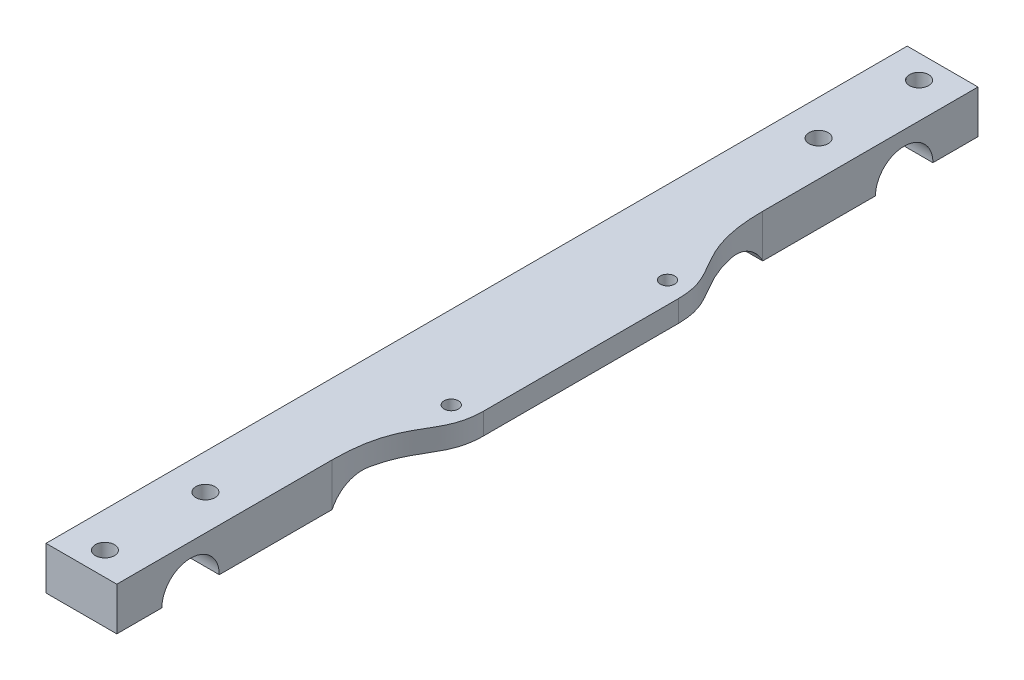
ISO-10303-21;
HEADER;
FILE_DESCRIPTION(('STEP AP214'),'2;1');
FILE_NAME('part.step','',(''),(''),'','','');
FILE_SCHEMA(('AUTOMOTIVE_DESIGN { 1 0 10303 214 1 1 1 1 }'));
ENDSEC;
DATA;
#1=APPLICATION_CONTEXT('core data for automotive mechanical design processes');
#2=APPLICATION_PROTOCOL_DEFINITION('international standard','automotive_design',2000,#1);
#3=PRODUCT_CONTEXT('',#1,'mechanical');
#4=PRODUCT('Part','Part','',(#3));
#5=PRODUCT_RELATED_PRODUCT_CATEGORY('part','',(#4));
#6=PRODUCT_DEFINITION_FORMATION('','',#4);
#7=PRODUCT_DEFINITION_CONTEXT('part definition',#1,'design');
#8=PRODUCT_DEFINITION('design','',#6,#7);
#9=PRODUCT_DEFINITION_SHAPE('','',#8);
#10=(LENGTH_UNIT() NAMED_UNIT(*) SI_UNIT(.MILLI.,.METRE.));
#11=(NAMED_UNIT(*) PLANE_ANGLE_UNIT() SI_UNIT($,.RADIAN.));
#12=(NAMED_UNIT(*) SI_UNIT($,.STERADIAN.) SOLID_ANGLE_UNIT());
#13=UNCERTAINTY_MEASURE_WITH_UNIT(LENGTH_MEASURE(1.E-05),#10,'distance_accuracy_value','');
#14=(GEOMETRIC_REPRESENTATION_CONTEXT(3) GLOBAL_UNCERTAINTY_ASSIGNED_CONTEXT((#13)) GLOBAL_UNIT_ASSIGNED_CONTEXT((#10,
#11,#12)) REPRESENTATION_CONTEXT('',''));
#15=CARTESIAN_POINT('',(0.,0.,0.));
#16=DIRECTION('',(0.,0.,1.));
#17=DIRECTION('',(1.,0.,0.));
#18=AXIS2_PLACEMENT_3D('',#15,#16,#17);
#19=CARTESIAN_POINT('',(14.8,0.,0.));
#20=DIRECTION('',(-1.,0.,0.));
#21=DIRECTION('',(0.,0.,1.));
#22=AXIS2_PLACEMENT_3D('',#19,#20,#21);
#23=PLANE('',#22);
#24=DIRECTION('',(0.,0.,1.));
#25=VECTOR('',#24,1.);
#26=CARTESIAN_POINT('',(14.8,4.5,90.));
#27=LINE('',#26,#25);
#28=CARTESIAN_POINT('',(14.8,4.5,45.));
#29=VERTEX_POINT('',#28);
#30=CARTESIAN_POINT('',(14.8,4.5,90.));
#31=VERTEX_POINT('',#30);
#32=EDGE_CURVE('E336',#29,#31,#27,.T.);
#33=ORIENTED_EDGE('',*,*,#32,.T.);
#34=DIRECTION('',(0.,-1.,0.));
#35=VECTOR('',#34,1.);
#36=CARTESIAN_POINT('',(14.8,-4.5,90.));
#37=LINE('',#36,#35);
#38=CARTESIAN_POINT('',(14.8,-4.5,90.));
#39=VERTEX_POINT('',#38);
#40=EDGE_CURVE('E340',#31,#39,#37,.T.);
#41=ORIENTED_EDGE('',*,*,#40,.T.);
#42=DIRECTION('',(0.,0.,-1.));
#43=VECTOR('',#42,1.);
#44=CARTESIAN_POINT('',(14.8,-4.5,90.));
#45=LINE('',#44,#43);
#46=CARTESIAN_POINT('',(14.8,-4.5,80.579));
#47=VERTEX_POINT('',#46);
#48=EDGE_CURVE('E368',#39,#47,#45,.T.);
#49=ORIENTED_EDGE('',*,*,#48,.T.);
#50=CARTESIAN_POINT('',(14.8,-4.5,74.579));
#51=DIRECTION('',(1.,0.,0.));
#52=DIRECTION('',(0.,0.,-1.));
#53=AXIS2_PLACEMENT_3D('',#50,#51,#52);
#54=CIRCLE('',#53,6.00000000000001);
#55=CARTESIAN_POINT('',(14.8,-4.5,68.579));
#56=VERTEX_POINT('',#55);
#57=EDGE_CURVE('E317',#56,#47,#54,.T.);
#58=ORIENTED_EDGE('',*,*,#57,.F.);
#59=CARTESIAN_POINT('',(14.8,-4.5,45.));
#60=VERTEX_POINT('',#59);
#61=EDGE_CURVE('E380',#56,#60,#45,.T.);
#62=ORIENTED_EDGE('',*,*,#61,.T.);
#63=DIRECTION('',(0.,-1.,0.));
#64=VECTOR('',#63,1.);
#65=CARTESIAN_POINT('',(14.8,0.,45.));
#66=LINE('',#65,#64);
#67=EDGE_CURVE('E79',#29,#60,#66,.T.);
#68=ORIENTED_EDGE('',*,*,#67,.F.);
#69=EDGE_LOOP('',(#33,#41,#49,#58,#62,#68));
#70=FACE_BOUND('',#69,.T.);
#71=ADVANCED_FACE('F41',(#70),#23,.F.);
#72=CARTESIAN_POINT('',(14.8,4.5,-90.));
#73=VERTEX_POINT('',#72);
#74=CARTESIAN_POINT('',(14.8,4.5,-45.));
#75=VERTEX_POINT('',#74);
#76=EDGE_CURVE('E88',#73,#75,#27,.T.);
#77=ORIENTED_EDGE('',*,*,#76,.T.);
#78=DIRECTION('',(0.,1.,0.));
#79=VECTOR('',#78,1.);
#80=CARTESIAN_POINT('',(14.8,0.,-45.));
#81=LINE('',#80,#79);
#82=CARTESIAN_POINT('',(14.8,-4.49999999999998,-45.));
#83=VERTEX_POINT('',#82);
#84=EDGE_CURVE('E57',#83,#75,#81,.T.);
#85=ORIENTED_EDGE('',*,*,#84,.F.);
#86=CARTESIAN_POINT('',(14.8,-4.5,-68.579));
#87=VERTEX_POINT('',#86);
#88=EDGE_CURVE('E381',#83,#87,#45,.T.);
#89=ORIENTED_EDGE('',*,*,#88,.T.);
#90=CARTESIAN_POINT('',(14.8,-4.5,-74.579));
#91=DIRECTION('',(1.,0.,0.));
#92=DIRECTION('',(0.,0.,-1.));
#93=AXIS2_PLACEMENT_3D('',#90,#91,#92);
#94=CIRCLE('',#93,6.00000000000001);
#95=CARTESIAN_POINT('',(14.8,-4.5,-80.579));
#96=VERTEX_POINT('',#95);
#97=EDGE_CURVE('E319',#96,#87,#94,.T.);
#98=ORIENTED_EDGE('',*,*,#97,.F.);
#99=CARTESIAN_POINT('',(14.8,-4.5,-90.));
#100=VERTEX_POINT('',#99);
#101=EDGE_CURVE('E385',#96,#100,#45,.T.);
#102=ORIENTED_EDGE('',*,*,#101,.T.);
#103=DIRECTION('',(0.,1.,0.));
#104=VECTOR('',#103,1.);
#105=CARTESIAN_POINT('',(14.8,-4.5,-90.));
#106=LINE('',#105,#104);
#107=EDGE_CURVE('E334',#100,#73,#106,.T.);
#108=ORIENTED_EDGE('',*,*,#107,.T.);
#109=EDGE_LOOP('',(#77,#85,#89,#98,#102,#108));
#110=FACE_BOUND('',#109,.T.);
#111=ADVANCED_FACE('F214',(#110),#23,.F.);
#112=CARTESIAN_POINT('',(14.8,-4.5,90.));
#113=DIRECTION('',(0.,1.,0.));
#114=DIRECTION('',(0.,0.,1.));
#115=AXIS2_PLACEMENT_3D('',#112,#113,#114);
#116=PLANE('',#115);
#117=CARTESIAN_POINT('',(7.40000000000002,-4.5,64.079));
#118=DIRECTION('',(0.,1.,0.));
#119=DIRECTION('',(0.,0.,1.));
#120=AXIS2_PLACEMENT_3D('',#117,#118,#119);
#121=CIRCLE('',#120,2.);
#122=CARTESIAN_POINT('',(7.40000000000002,-4.5,66.079));
#123=VERTEX_POINT('',#122);
#124=EDGE_CURVE('E289',#123,#123,#121,.T.);
#125=ORIENTED_EDGE('',*,*,#124,.T.);
#126=EDGE_LOOP('',(#125));
#127=FACE_BOUND('',#126,.T.);
#128=DIRECTION('',(0.,0.,-1.));
#129=VECTOR('',#128,1.);
#130=CARTESIAN_POINT('',(0.,-4.5,90.));
#131=LINE('',#130,#129);
#132=CARTESIAN_POINT('',(0.,-4.5,68.579));
#133=VERTEX_POINT('',#132);
#134=CARTESIAN_POINT('',(0.,-4.5,45.));
#135=VERTEX_POINT('',#134);
#136=EDGE_CURVE('E371',#133,#135,#131,.T.);
#137=ORIENTED_EDGE('',*,*,#136,.T.);
#138=DIRECTION('',(1.,0.,0.));
#139=VECTOR('',#138,1.);
#140=CARTESIAN_POINT('',(0.,-4.5,45.));
#141=LINE('',#140,#139);
#142=EDGE_CURVE('E283',#135,#60,#141,.T.);
#143=ORIENTED_EDGE('',*,*,#142,.T.);
#144=ORIENTED_EDGE('',*,*,#61,.F.);
#145=DIRECTION('',(1.,0.,0.));
#146=VECTOR('',#145,1.);
#147=CARTESIAN_POINT('',(0.,-4.5,68.579));
#148=LINE('',#147,#146);
#149=EDGE_CURVE('E316',#133,#56,#148,.T.);
#150=ORIENTED_EDGE('',*,*,#149,.F.);
#151=EDGE_LOOP('',(#137,#143,#144,#150));
#152=FACE_BOUND('',#151,.T.);
#153=ADVANCED_FACE('F207',(#127,#152),#116,.F.);
#154=CARTESIAN_POINT('',(7.40000000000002,-4.5,85.079));
#155=DIRECTION('',(0.,1.,0.));
#156=DIRECTION('',(0.,0.,1.));
#157=AXIS2_PLACEMENT_3D('',#154,#155,#156);
#158=CIRCLE('',#157,2.);
#159=CARTESIAN_POINT('',(7.40000000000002,-4.5,87.079));
#160=VERTEX_POINT('',#159);
#161=EDGE_CURVE('E296',#160,#160,#158,.T.);
#162=ORIENTED_EDGE('',*,*,#161,.T.);
#163=EDGE_LOOP('',(#162));
#164=FACE_BOUND('',#163,.T.);
#165=CARTESIAN_POINT('',(0.,-4.5,90.));
#166=VERTEX_POINT('',#165);
#167=CARTESIAN_POINT('',(0.,-4.5,80.579));
#168=VERTEX_POINT('',#167);
#169=EDGE_CURVE('E337',#166,#168,#131,.T.);
#170=ORIENTED_EDGE('',*,*,#169,.T.);
#171=DIRECTION('',(1.,0.,0.));
#172=VECTOR('',#171,1.);
#173=CARTESIAN_POINT('',(0.,-4.5,80.579));
#174=LINE('',#173,#172);
#175=EDGE_CURVE('E320',#168,#47,#174,.T.);
#176=ORIENTED_EDGE('',*,*,#175,.T.);
#177=ORIENTED_EDGE('',*,*,#48,.F.);
#178=DIRECTION('',(-1.,0.,0.));
#179=VECTOR('',#178,1.);
#180=CARTESIAN_POINT('',(14.8,-4.5,90.));
#181=LINE('',#180,#179);
#182=EDGE_CURVE('E362',#39,#166,#181,.T.);
#183=ORIENTED_EDGE('',*,*,#182,.T.);
#184=EDGE_LOOP('',(#170,#176,#177,#183));
#185=FACE_BOUND('',#184,.T.);
#186=ADVANCED_FACE('F396',(#164,#185),#116,.F.);
#187=CARTESIAN_POINT('',(7.40000000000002,-4.5,-64.079));
#188=DIRECTION('',(0.,1.,0.));
#189=DIRECTION('',(0.,0.,1.));
#190=AXIS2_PLACEMENT_3D('',#187,#188,#189);
#191=CIRCLE('',#190,2.);
#192=CARTESIAN_POINT('',(7.40000000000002,-4.5,-62.079));
#193=VERTEX_POINT('',#192);
#194=EDGE_CURVE('E307',#193,#193,#191,.T.);
#195=ORIENTED_EDGE('',*,*,#194,.T.);
#196=EDGE_LOOP('',(#195));
#197=FACE_BOUND('',#196,.T.);
#198=ORIENTED_EDGE('',*,*,#88,.F.);
#199=DIRECTION('',(1.,0.,0.));
#200=VECTOR('',#199,1.);
#201=CARTESIAN_POINT('',(0.,-4.49999999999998,-45.));
#202=LINE('',#201,#200);
#203=CARTESIAN_POINT('',(0.,-4.49999999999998,-45.));
#204=VERTEX_POINT('',#203);
#205=EDGE_CURVE('E284',#204,#83,#202,.T.);
#206=ORIENTED_EDGE('',*,*,#205,.F.);
#207=CARTESIAN_POINT('',(0.,-4.5,-68.579));
#208=VERTEX_POINT('',#207);
#209=EDGE_CURVE('E372',#204,#208,#131,.T.);
#210=ORIENTED_EDGE('',*,*,#209,.T.);
#211=DIRECTION('',(1.,0.,0.));
#212=VECTOR('',#211,1.);
#213=CARTESIAN_POINT('',(0.,-4.5,-68.579));
#214=LINE('',#213,#212);
#215=EDGE_CURVE('E310',#208,#87,#214,.T.);
#216=ORIENTED_EDGE('',*,*,#215,.T.);
#217=EDGE_LOOP('',(#198,#206,#210,#216));
#218=FACE_BOUND('',#217,.T.);
#219=ADVANCED_FACE('F193',(#197,#218),#116,.F.);
#220=CARTESIAN_POINT('',(14.8,-4.5,-90.));
#221=DIRECTION('',(0.,0.,1.));
#222=DIRECTION('',(1.,0.,0.));
#223=AXIS2_PLACEMENT_3D('',#220,#221,#222);
#224=PLANE('',#223);
#225=DIRECTION('',(0.,1.,0.));
#226=VECTOR('',#225,1.);
#227=CARTESIAN_POINT('',(0.,-4.5,-90.));
#228=LINE('',#227,#226);
#229=CARTESIAN_POINT('',(0.,-4.5,-90.));
#230=VERTEX_POINT('',#229);
#231=CARTESIAN_POINT('',(0.,4.5,-90.));
#232=VERTEX_POINT('',#231);
#233=EDGE_CURVE('E323',#230,#232,#228,.T.);
#234=ORIENTED_EDGE('',*,*,#233,.T.);
#235=DIRECTION('',(-1.,0.,0.));
#236=VECTOR('',#235,1.);
#237=CARTESIAN_POINT('',(14.8,4.5,-90.));
#238=LINE('',#237,#236);
#239=EDGE_CURVE('E356',#73,#232,#238,.T.);
#240=ORIENTED_EDGE('',*,*,#239,.F.);
#241=ORIENTED_EDGE('',*,*,#107,.F.);
#242=DIRECTION('',(-1.,0.,0.));
#243=VECTOR('',#242,1.);
#244=CARTESIAN_POINT('',(14.8,-4.5,-90.));
#245=LINE('',#244,#243);
#246=EDGE_CURVE('E365',#100,#230,#245,.T.);
#247=ORIENTED_EDGE('',*,*,#246,.T.);
#248=EDGE_LOOP('',(#234,#240,#241,#247));
#249=FACE_BOUND('',#248,.T.);
#250=ADVANCED_FACE('F189',(#249),#224,.F.);
#251=CARTESIAN_POINT('',(14.8,4.5,90.));
#252=DIRECTION('',(0.,-1.,0.));
#253=DIRECTION('',(0.,0.,-1.));
#254=AXIS2_PLACEMENT_3D('',#251,#252,#253);
#255=PLANE('',#254);
#256=CARTESIAN_POINT('',(17.2994949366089,4.5,22.6005050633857));
#257=DIRECTION('',(0.,-1.,0.));
#258=DIRECTION('',(0.,0.,-1.));
#259=AXIS2_PLACEMENT_3D('',#256,#257,#258);
#260=CIRCLE('',#259,1.50000000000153);
#261=CARTESIAN_POINT('',(17.2994949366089,4.5,21.1005050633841));
#262=VERTEX_POINT('',#261);
#263=EDGE_CURVE('E264',#262,#262,#260,.T.);
#264=ORIENTED_EDGE('',*,*,#263,.T.);
#265=EDGE_LOOP('',(#264));
#266=FACE_BOUND('',#265,.T.);
#267=CARTESIAN_POINT('',(17.2994949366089,4.5,-22.6005050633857));
#268=DIRECTION('',(0.,-1.,0.));
#269=DIRECTION('',(0.,0.,-1.));
#270=AXIS2_PLACEMENT_3D('',#267,#268,#269);
#271=CIRCLE('',#270,1.50000000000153);
#272=CARTESIAN_POINT('',(17.2994949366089,4.5,-24.1005050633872));
#273=VERTEX_POINT('',#272);
#274=EDGE_CURVE('E262',#273,#273,#271,.T.);
#275=ORIENTED_EDGE('',*,*,#274,.T.);
#276=EDGE_LOOP('',(#275));
#277=FACE_BOUND('',#276,.T.);
#278=CARTESIAN_POINT('',(7.40000000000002,4.5,-85.079));
#279=DIRECTION('',(0.,1.,0.));
#280=DIRECTION('',(0.,0.,1.));
#281=AXIS2_PLACEMENT_3D('',#278,#279,#280);
#282=CIRCLE('',#281,2.);
#283=CARTESIAN_POINT('',(7.40000000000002,4.5,-83.079));
#284=VERTEX_POINT('',#283);
#285=EDGE_CURVE('E287',#284,#284,#282,.T.);
#286=ORIENTED_EDGE('',*,*,#285,.F.);
#287=EDGE_LOOP('',(#286));
#288=FACE_BOUND('',#287,.T.);
#289=CARTESIAN_POINT('',(7.40000000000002,4.5,85.079));
#290=DIRECTION('',(0.,1.,0.));
#291=DIRECTION('',(0.,0.,1.));
#292=AXIS2_PLACEMENT_3D('',#289,#290,#291);
#293=CIRCLE('',#292,2.);
#294=CARTESIAN_POINT('',(7.40000000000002,4.5,87.079));
#295=VERTEX_POINT('',#294);
#296=EDGE_CURVE('E299',#295,#295,#293,.T.);
#297=ORIENTED_EDGE('',*,*,#296,.F.);
#298=EDGE_LOOP('',(#297));
#299=FACE_BOUND('',#298,.T.);
#300=CARTESIAN_POINT('',(7.40000000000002,4.5,64.079));
#301=DIRECTION('',(0.,1.,0.));
#302=DIRECTION('',(0.,0.,1.));
#303=AXIS2_PLACEMENT_3D('',#300,#301,#302);
#304=CIRCLE('',#303,2.);
#305=CARTESIAN_POINT('',(7.40000000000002,4.5,66.079));
#306=VERTEX_POINT('',#305);
#307=EDGE_CURVE('E293',#306,#306,#304,.T.);
#308=ORIENTED_EDGE('',*,*,#307,.F.);
#309=EDGE_LOOP('',(#308));
#310=FACE_BOUND('',#309,.T.);
#311=CARTESIAN_POINT('',(7.40000000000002,4.5,-64.079));
#312=DIRECTION('',(0.,1.,0.));
#313=DIRECTION('',(0.,0.,1.));
#314=AXIS2_PLACEMENT_3D('',#311,#312,#313);
#315=CIRCLE('',#314,2.);
#316=CARTESIAN_POINT('',(7.40000000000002,4.5,-62.079));
#317=VERTEX_POINT('',#316);
#318=EDGE_CURVE('E292',#317,#317,#315,.T.);
#319=ORIENTED_EDGE('',*,*,#318,.F.);
#320=EDGE_LOOP('',(#319));
#321=FACE_BOUND('',#320,.T.);
#322=DIRECTION('',(0.,0.,1.));
#323=VECTOR('',#322,1.);
#324=CARTESIAN_POINT('',(21.8,4.5,45.));
#325=LINE('',#324,#323);
#326=CARTESIAN_POINT('',(21.8,4.5,-20.3664277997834));
#327=VERTEX_POINT('',#326);
#328=CARTESIAN_POINT('',(21.8,4.5,20.3664277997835));
#329=VERTEX_POINT('',#328);
#330=EDGE_CURVE('E278',#327,#329,#325,.T.);
#331=ORIENTED_EDGE('',*,*,#330,.F.);
#332=CARTESIAN_POINT('',(21.8,4.50000000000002,-20.3664277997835));
#333=CARTESIAN_POINT('',(21.8,4.50000000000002,-29.7858355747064));
#334=CARTESIAN_POINT('',(14.8,4.50000000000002,-29.7858355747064));
#335=CARTESIAN_POINT('',(14.8,4.50000000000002,-45.));
#336=B_SPLINE_CURVE_WITH_KNOTS('',3,(#332,#333,#334,#335),.UNSPECIFIED.,.F.,.F.,(4,4),(0.,1.),.UNSPECIFIED.);
#337=EDGE_CURVE('E265',#327,#75,#336,.T.);
#338=ORIENTED_EDGE('',*,*,#337,.T.);
#339=ORIENTED_EDGE('',*,*,#76,.F.);
#340=ORIENTED_EDGE('',*,*,#239,.T.);
#341=DIRECTION('',(0.,0.,1.));
#342=VECTOR('',#341,1.);
#343=CARTESIAN_POINT('',(0.,4.5,90.));
#344=LINE('',#343,#342);
#345=CARTESIAN_POINT('',(0.,4.5,90.));
#346=VERTEX_POINT('',#345);
#347=EDGE_CURVE('E376',#232,#346,#344,.T.);
#348=ORIENTED_EDGE('',*,*,#347,.T.);
#349=DIRECTION('',(-1.,0.,0.));
#350=VECTOR('',#349,1.);
#351=CARTESIAN_POINT('',(14.8,4.5,90.));
#352=LINE('',#351,#350);
#353=EDGE_CURVE('E359',#31,#346,#352,.T.);
#354=ORIENTED_EDGE('',*,*,#353,.F.);
#355=ORIENTED_EDGE('',*,*,#32,.F.);
#356=CARTESIAN_POINT('',(14.8,4.50000000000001,45.));
#357=CARTESIAN_POINT('',(14.8,4.50000000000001,29.7858355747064));
#358=CARTESIAN_POINT('',(21.8,4.50000000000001,29.7858355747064));
#359=CARTESIAN_POINT('',(21.8,4.50000000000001,20.3664277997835));
#360=B_SPLINE_CURVE_WITH_KNOTS('',3,(#356,#357,#358,#359),.UNSPECIFIED.,.F.,.F.,(4,4),(0.,1.),.UNSPECIFIED.);
#361=EDGE_CURVE('E270',#29,#329,#360,.T.);
#362=ORIENTED_EDGE('',*,*,#361,.T.);
#363=EDGE_LOOP('',(#331,#338,#339,#340,#348,#354,#355,#362));
#364=FACE_BOUND('',#363,.T.);
#365=ADVANCED_FACE('F192',(#266,#277,#288,#299,#310,#321,#364),#255,.F.);
#366=CARTESIAN_POINT('',(14.8,-4.5,90.));
#367=DIRECTION('',(0.,0.,-1.));
#368=DIRECTION('',(-1.,0.,0.));
#369=AXIS2_PLACEMENT_3D('',#366,#367,#368);
#370=PLANE('',#369);
#371=DIRECTION('',(0.,-1.,0.));
#372=VECTOR('',#371,1.);
#373=CARTESIAN_POINT('',(0.,-4.5,90.));
#374=LINE('',#373,#372);
#375=EDGE_CURVE('E373',#346,#166,#374,.T.);
#376=ORIENTED_EDGE('',*,*,#375,.T.);
#377=ORIENTED_EDGE('',*,*,#182,.F.);
#378=ORIENTED_EDGE('',*,*,#40,.F.);
#379=ORIENTED_EDGE('',*,*,#353,.T.);
#380=EDGE_LOOP('',(#376,#377,#378,#379));
#381=FACE_BOUND('',#380,.T.);
#382=ADVANCED_FACE('F197',(#381),#370,.F.);
#383=CARTESIAN_POINT('',(7.40000000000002,-4.5,-85.079));
#384=DIRECTION('',(0.,1.,0.));
#385=DIRECTION('',(0.,0.,1.));
#386=AXIS2_PLACEMENT_3D('',#383,#384,#385);
#387=CIRCLE('',#386,2.);
#388=CARTESIAN_POINT('',(7.40000000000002,-4.5,-83.079));
#389=VERTEX_POINT('',#388);
#390=EDGE_CURVE('E302',#389,#389,#387,.T.);
#391=ORIENTED_EDGE('',*,*,#390,.T.);
#392=EDGE_LOOP('',(#391));
#393=FACE_BOUND('',#392,.T.);
#394=ORIENTED_EDGE('',*,*,#101,.F.);
#395=DIRECTION('',(1.,0.,0.));
#396=VECTOR('',#395,1.);
#397=CARTESIAN_POINT('',(0.,-4.5,-80.579));
#398=LINE('',#397,#396);
#399=CARTESIAN_POINT('',(0.,-4.5,-80.579));
#400=VERTEX_POINT('',#399);
#401=EDGE_CURVE('E325',#400,#96,#398,.T.);
#402=ORIENTED_EDGE('',*,*,#401,.F.);
#403=EDGE_CURVE('E375',#400,#230,#131,.T.);
#404=ORIENTED_EDGE('',*,*,#403,.T.);
#405=ORIENTED_EDGE('',*,*,#246,.F.);
#406=EDGE_LOOP('',(#394,#402,#404,#405));
#407=FACE_BOUND('',#406,.T.);
#408=ADVANCED_FACE('F201',(#393,#407),#116,.F.);
#409=CARTESIAN_POINT('',(0.,0.,0.));
#410=DIRECTION('',(-1.,0.,0.));
#411=DIRECTION('',(0.,0.,1.));
#412=AXIS2_PLACEMENT_3D('',#409,#410,#411);
#413=PLANE('',#412);
#414=DIRECTION('',(0.,0.,1.));
#415=VECTOR('',#414,1.);
#416=CARTESIAN_POINT('',(0.,0.,45.));
#417=LINE('',#416,#415);
#418=CARTESIAN_POINT('',(0.,0.,-37.8062527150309));
#419=VERTEX_POINT('',#418);
#420=CARTESIAN_POINT('',(0.,0.,37.8062527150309));
#421=VERTEX_POINT('',#420);
#422=EDGE_CURVE('E281',#419,#421,#417,.T.);
#423=ORIENTED_EDGE('',*,*,#422,.T.);
#424=CARTESIAN_POINT('',(0.,-8.,37.8062527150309));
#425=DIRECTION('',(-1.,0.,0.));
#426=DIRECTION('',(0.,0.,1.));
#427=AXIS2_PLACEMENT_3D('',#424,#425,#426);
#428=CIRCLE('',#427,8.);
#429=EDGE_CURVE('E157',#421,#135,#428,.F.);
#430=ORIENTED_EDGE('',*,*,#429,.T.);
#431=ORIENTED_EDGE('',*,*,#136,.F.);
#432=CARTESIAN_POINT('',(0.,-4.5,74.579));
#433=DIRECTION('',(1.,0.,0.));
#434=DIRECTION('',(0.,0.,-1.));
#435=AXIS2_PLACEMENT_3D('',#432,#433,#434);
#436=CIRCLE('',#435,6.00000000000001);
#437=EDGE_CURVE('E313',#133,#168,#436,.T.);
#438=ORIENTED_EDGE('',*,*,#437,.T.);
#439=ORIENTED_EDGE('',*,*,#169,.F.);
#440=ORIENTED_EDGE('',*,*,#375,.F.);
#441=ORIENTED_EDGE('',*,*,#347,.F.);
#442=ORIENTED_EDGE('',*,*,#233,.F.);
#443=ORIENTED_EDGE('',*,*,#403,.F.);
#444=CARTESIAN_POINT('',(0.,-4.5,-74.579));
#445=DIRECTION('',(1.,0.,0.));
#446=DIRECTION('',(0.,0.,-1.));
#447=AXIS2_PLACEMENT_3D('',#444,#445,#446);
#448=CIRCLE('',#447,6.00000000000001);
#449=EDGE_CURVE('E327',#400,#208,#448,.T.);
#450=ORIENTED_EDGE('',*,*,#449,.T.);
#451=ORIENTED_EDGE('',*,*,#209,.F.);
#452=CARTESIAN_POINT('',(0.,-7.99999999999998,-37.8062527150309));
#453=DIRECTION('',(-1.,0.,0.));
#454=DIRECTION('',(0.,0.,1.));
#455=AXIS2_PLACEMENT_3D('',#452,#453,#454);
#456=CIRCLE('',#455,8.);
#457=EDGE_CURVE('E11',#204,#419,#456,.F.);
#458=ORIENTED_EDGE('',*,*,#457,.T.);
#459=EDGE_LOOP('',(#423,#430,#431,#438,#439,#440,#441,#442,#443,#450,#451,#458));
#460=FACE_BOUND('',#459,.T.);
#461=ADVANCED_FACE('F205',(#460),#413,.T.);
#462=CARTESIAN_POINT('',(0.,-4.5,-74.579));
#463=DIRECTION('',(1.,0.,0.));
#464=DIRECTION('',(0.,0.,-1.));
#465=AXIS2_PLACEMENT_3D('',#462,#463,#464);
#466=CYLINDRICAL_SURFACE('',#465,6.00000000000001);
#467=ORIENTED_EDGE('',*,*,#97,.T.);
#468=ORIENTED_EDGE('',*,*,#215,.F.);
#469=ORIENTED_EDGE('',*,*,#449,.F.);
#470=ORIENTED_EDGE('',*,*,#401,.T.);
#471=EDGE_LOOP('',(#467,#468,#469,#470));
#472=FACE_BOUND('',#471,.T.);
#473=ADVANCED_FACE('F210',(#472),#466,.F.);
#474=CARTESIAN_POINT('',(0.,-4.5,74.579));
#475=DIRECTION('',(1.,0.,0.));
#476=DIRECTION('',(0.,0.,-1.));
#477=AXIS2_PLACEMENT_3D('',#474,#475,#476);
#478=CYLINDRICAL_SURFACE('',#477,6.00000000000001);
#479=ORIENTED_EDGE('',*,*,#57,.T.);
#480=ORIENTED_EDGE('',*,*,#175,.F.);
#481=ORIENTED_EDGE('',*,*,#437,.F.);
#482=ORIENTED_EDGE('',*,*,#149,.T.);
#483=EDGE_LOOP('',(#479,#480,#481,#482));
#484=FACE_BOUND('',#483,.T.);
#485=ADVANCED_FACE('F218',(#484),#478,.F.);
#486=CARTESIAN_POINT('',(7.40000000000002,-4.5,-85.079));
#487=DIRECTION('',(0.,1.,0.));
#488=DIRECTION('',(0.,0.,1.));
#489=AXIS2_PLACEMENT_3D('',#486,#487,#488);
#490=CYLINDRICAL_SURFACE('',#489,2.);
#491=ORIENTED_EDGE('',*,*,#390,.F.);
#492=EDGE_LOOP('',(#491));
#493=FACE_BOUND('',#492,.T.);
#494=ORIENTED_EDGE('',*,*,#285,.T.);
#495=EDGE_LOOP('',(#494));
#496=FACE_BOUND('',#495,.T.);
#497=ADVANCED_FACE('F222',(#493,#496),#490,.F.);
#498=CARTESIAN_POINT('',(7.40000000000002,-4.5,-64.079));
#499=DIRECTION('',(0.,1.,0.));
#500=DIRECTION('',(0.,0.,1.));
#501=AXIS2_PLACEMENT_3D('',#498,#499,#500);
#502=CYLINDRICAL_SURFACE('',#501,2.);
#503=ORIENTED_EDGE('',*,*,#194,.F.);
#504=EDGE_LOOP('',(#503));
#505=FACE_BOUND('',#504,.T.);
#506=ORIENTED_EDGE('',*,*,#318,.T.);
#507=EDGE_LOOP('',(#506));
#508=FACE_BOUND('',#507,.T.);
#509=ADVANCED_FACE('F224',(#505,#508),#502,.F.);
#510=CARTESIAN_POINT('',(7.40000000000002,-4.5,64.079));
#511=DIRECTION('',(0.,1.,0.));
#512=DIRECTION('',(0.,0.,1.));
#513=AXIS2_PLACEMENT_3D('',#510,#511,#512);
#514=CYLINDRICAL_SURFACE('',#513,2.);
#515=ORIENTED_EDGE('',*,*,#124,.F.);
#516=EDGE_LOOP('',(#515));
#517=FACE_BOUND('',#516,.T.);
#518=ORIENTED_EDGE('',*,*,#307,.T.);
#519=EDGE_LOOP('',(#518));
#520=FACE_BOUND('',#519,.T.);
#521=ADVANCED_FACE('F227',(#517,#520),#514,.F.);
#522=CARTESIAN_POINT('',(7.40000000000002,-4.5,85.079));
#523=DIRECTION('',(0.,1.,0.));
#524=DIRECTION('',(0.,0.,1.));
#525=AXIS2_PLACEMENT_3D('',#522,#523,#524);
#526=CYLINDRICAL_SURFACE('',#525,2.);
#527=ORIENTED_EDGE('',*,*,#161,.F.);
#528=EDGE_LOOP('',(#527));
#529=FACE_BOUND('',#528,.T.);
#530=ORIENTED_EDGE('',*,*,#296,.T.);
#531=EDGE_LOOP('',(#530));
#532=FACE_BOUND('',#531,.T.);
#533=ADVANCED_FACE('F232',(#529,#532),#526,.F.);
#534=CARTESIAN_POINT('',(0.,0.,45.));
#535=DIRECTION('',(0.,1.,0.));
#536=DIRECTION('',(0.,0.,1.));
#537=AXIS2_PLACEMENT_3D('',#534,#535,#536);
#538=PLANE('',#537);
#539=CARTESIAN_POINT('',(17.2994949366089,0.,22.6005050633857));
#540=DIRECTION('',(0.,-1.,0.));
#541=DIRECTION('',(0.,0.,1.));
#542=AXIS2_PLACEMENT_3D('',#539,#540,#541);
#543=CIRCLE('',#542,1.50000000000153);
#544=CARTESIAN_POINT('',(17.2994949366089,0.,24.1005050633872));
#545=VERTEX_POINT('',#544);
#546=EDGE_CURVE('E165',#545,#545,#543,.T.);
#547=ORIENTED_EDGE('',*,*,#546,.F.);
#548=EDGE_LOOP('',(#547));
#549=FACE_BOUND('',#548,.T.);
#550=CARTESIAN_POINT('',(17.2994949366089,0.,-22.6005050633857));
#551=DIRECTION('',(0.,-1.,0.));
#552=DIRECTION('',(0.,0.,-1.));
#553=AXIS2_PLACEMENT_3D('',#550,#551,#552);
#554=CIRCLE('',#553,1.50000000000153);
#555=CARTESIAN_POINT('',(17.2994949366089,0.,-24.1005050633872));
#556=VERTEX_POINT('',#555);
#557=EDGE_CURVE('E259',#556,#556,#554,.T.);
#558=ORIENTED_EDGE('',*,*,#557,.F.);
#559=EDGE_LOOP('',(#558));
#560=FACE_BOUND('',#559,.T.);
#561=CARTESIAN_POINT('',(14.8,0.,45.));
#562=CARTESIAN_POINT('',(14.8,0.,29.7858355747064));
#563=CARTESIAN_POINT('',(21.8,0.,29.7858355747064));
#564=CARTESIAN_POINT('',(21.8,0.,20.3664277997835));
#565=B_SPLINE_CURVE_WITH_KNOTS('',3,(#561,#562,#563,#564),.UNSPECIFIED.,.F.,.F.,(4,4),(0.,1.),.UNSPECIFIED.);
#566=CARTESIAN_POINT('',(15.4621587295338,0.,37.8062527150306));
#567=VERTEX_POINT('',#566);
#568=CARTESIAN_POINT('',(21.8,0.,20.3664277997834));
#569=VERTEX_POINT('',#568);
#570=EDGE_CURVE('E152',#567,#569,#565,.T.);
#571=ORIENTED_EDGE('',*,*,#570,.F.);
#572=DIRECTION('',(-1.,0.,0.));
#573=VECTOR('',#572,1.);
#574=CARTESIAN_POINT('',(0.,0.,37.8062527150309));
#575=LINE('',#574,#573);
#576=EDGE_CURVE('E66',#567,#421,#575,.T.);
#577=ORIENTED_EDGE('',*,*,#576,.T.);
#578=ORIENTED_EDGE('',*,*,#422,.F.);
#579=DIRECTION('',(1.,0.,0.));
#580=VECTOR('',#579,1.);
#581=CARTESIAN_POINT('',(0.,0.,-37.8062527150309));
#582=LINE('',#581,#580);
#583=CARTESIAN_POINT('',(15.4621587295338,0.,-37.8062527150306));
#584=VERTEX_POINT('',#583);
#585=EDGE_CURVE('E169',#419,#584,#582,.T.);
#586=ORIENTED_EDGE('',*,*,#585,.T.);
#587=CARTESIAN_POINT('',(21.8,0.,-20.3664277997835));
#588=CARTESIAN_POINT('',(21.8,0.,-29.7858355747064));
#589=CARTESIAN_POINT('',(14.8,0.,-29.7858355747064));
#590=CARTESIAN_POINT('',(14.8,0.,-45.));
#591=B_SPLINE_CURVE_WITH_KNOTS('',3,(#587,#588,#589,#590),.UNSPECIFIED.,.F.,.F.,(4,4),(0.,1.),.UNSPECIFIED.);
#592=CARTESIAN_POINT('',(21.8,0.,-20.3664277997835));
#593=VERTEX_POINT('',#592);
#594=EDGE_CURVE('E164',#593,#584,#591,.T.);
#595=ORIENTED_EDGE('',*,*,#594,.F.);
#596=DIRECTION('',(0.,0.,-1.));
#597=VECTOR('',#596,1.);
#598=CARTESIAN_POINT('',(21.8,0.,-45.));
#599=LINE('',#598,#597);
#600=EDGE_CURVE('E163',#569,#593,#599,.T.);
#601=ORIENTED_EDGE('',*,*,#600,.F.);
#602=EDGE_LOOP('',(#571,#577,#578,#586,#595,#601));
#603=FACE_BOUND('',#602,.T.);
#604=ADVANCED_FACE('F160',(#549,#560,#603),#538,.F.);
#605=CARTESIAN_POINT('',(21.8,0.,0.));
#606=DIRECTION('',(-1.,0.,0.));
#607=DIRECTION('',(0.,0.,1.));
#608=AXIS2_PLACEMENT_3D('',#605,#606,#607);
#609=PLANE('',#608);
#610=ORIENTED_EDGE('',*,*,#600,.T.);
#611=DIRECTION('',(0.,1.,0.));
#612=VECTOR('',#611,1.);
#613=CARTESIAN_POINT('',(21.8,0.,-20.3664277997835));
#614=LINE('',#613,#612);
#615=EDGE_CURVE('E172',#593,#327,#614,.T.);
#616=ORIENTED_EDGE('',*,*,#615,.T.);
#617=ORIENTED_EDGE('',*,*,#330,.T.);
#618=DIRECTION('',(0.,-1.,0.));
#619=VECTOR('',#618,1.);
#620=CARTESIAN_POINT('',(21.8,8.,20.3664277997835));
#621=LINE('',#620,#619);
#622=EDGE_CURVE('E354',#329,#569,#621,.T.);
#623=ORIENTED_EDGE('',*,*,#622,.T.);
#624=EDGE_LOOP('',(#610,#616,#617,#623));
#625=FACE_BOUND('',#624,.T.);
#626=ADVANCED_FACE('F241',(#625),#609,.F.);
#627=CARTESIAN_POINT('',(14.8,7.99999999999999,45.));
#628=CARTESIAN_POINT('',(14.8,7.99999999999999,29.7858355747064));
#629=CARTESIAN_POINT('',(21.8,7.99999999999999,29.7858355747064));
#630=CARTESIAN_POINT('',(21.8,8.,20.3664277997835));
#631=B_SPLINE_CURVE_WITH_KNOTS('',3,(#627,#628,#629,#630),.UNSPECIFIED.,.F.,.F.,(4,4),(0.,1.),.UNSPECIFIED.);
#632=DIRECTION('',(0.,-1.,0.));
#633=VECTOR('',#632,1.);
#634=SURFACE_OF_LINEAR_EXTRUSION('',#631,#633);
#635=ORIENTED_EDGE('',*,*,#67,.T.);
#636=CARTESIAN_POINT('',(14.8,-4.5,45.));
#637=CARTESIAN_POINT('',(14.8000084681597,-4.29857384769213,44.9020262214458));
#638=CARTESIAN_POINT('',(14.8002905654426,-4.1012857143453,44.795551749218));
#639=CARTESIAN_POINT('',(14.8017803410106,-3.71633142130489,44.566448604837));
#640=CARTESIAN_POINT('',(14.8029880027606,-3.52866508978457,44.4438202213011));
#641=CARTESIAN_POINT('',(14.8067063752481,-3.16437416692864,44.1833108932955));
#642=CARTESIAN_POINT('',(14.8092165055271,-2.98774469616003,44.0454367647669));
#643=CARTESIAN_POINT('',(14.8159710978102,-2.64668997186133,43.7553850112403));
#644=CARTESIAN_POINT('',(14.8202155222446,-2.48226445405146,43.6032076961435));
#645=CARTESIAN_POINT('',(14.8309044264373,-2.16668920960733,43.2855447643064));
#646=CARTESIAN_POINT('',(14.8373502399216,-2.01554760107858,43.1200511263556));
#647=CARTESIAN_POINT('',(14.8529311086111,-1.72772975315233,42.7770422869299));
#648=CARTESIAN_POINT('',(14.8620661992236,-1.5910537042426,42.5995269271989));
#649=CARTESIAN_POINT('',(14.8835287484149,-1.33315272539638,42.233803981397));
#650=CARTESIAN_POINT('',(14.8958559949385,-1.21192676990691,42.0455971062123));
#651=CARTESIAN_POINT('',(14.9242074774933,-0.985776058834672,41.6599048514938));
#652=CARTESIAN_POINT('',(14.9402315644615,-0.880850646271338,41.4624198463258));
#653=CARTESIAN_POINT('',(14.9763475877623,-0.68864998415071,41.0609965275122));
#654=CARTESIAN_POINT('',(14.9964122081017,-0.601263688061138,40.8571089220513));
#655=CARTESIAN_POINT('',(15.0411193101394,-0.443852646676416,40.4432304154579));
#656=CARTESIAN_POINT('',(15.0657616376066,-0.373827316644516,40.2332397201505));
#657=CARTESIAN_POINT('',(15.1199898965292,-0.251595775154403,39.8089818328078));
#658=CARTESIAN_POINT('',(15.1495711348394,-0.199372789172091,39.5947188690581));
#659=CARTESIAN_POINT('',(15.2139968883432,-0.112902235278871,39.1634637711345));
#660=CARTESIAN_POINT('',(15.2488389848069,-0.0786464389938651,38.9464729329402));
#661=CARTESIAN_POINT('',(15.3129793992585,-0.0355348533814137,38.5751890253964));
#662=CARTESIAN_POINT('',(15.340908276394,-0.0221767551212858,38.4211652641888));
#663=CARTESIAN_POINT('',(15.3994817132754,-0.00441501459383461,38.1134190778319));
#664=CARTESIAN_POINT('',(15.430121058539,5.44731080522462E-06,37.9596966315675));
#665=CARTESIAN_POINT('',(15.4621587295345,0.,37.8062527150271));
#666=B_SPLINE_CURVE_WITH_KNOTS('',3,(#636,#637,#638,#639,#640,#641,#642,#643,#644,#645,#646,
#647,#648,#649,#650,#651,#652,#653,#654,#655,#656,#657,#658,#659,#660,#661,#662,#663,#664,#665),
.UNSPECIFIED.,.F.,.F.,(4,2,2,2,2,2,2,2,2,2,2,2,2,2,4),(0.,0.671767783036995,1.3435235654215,
2.01498022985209,2.68642234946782,3.35827199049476,4.03013047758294,4.70194434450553,
5.37373112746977,6.04112020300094,6.70848679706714,7.37522280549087,8.04165320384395,
8.51270265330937,8.98286481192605),.UNSPECIFIED.);
#667=EDGE_CURVE('E150',#60,#567,#666,.T.);
#668=ORIENTED_EDGE('',*,*,#667,.T.);
#669=ORIENTED_EDGE('',*,*,#570,.T.);
#670=ORIENTED_EDGE('',*,*,#622,.F.);
#671=ORIENTED_EDGE('',*,*,#361,.F.);
#672=EDGE_LOOP('',(#635,#668,#669,#670,#671));
#673=FACE_BOUND('',#672,.T.);
#674=ADVANCED_FACE('F151',(#673),#634,.F.);
#675=CARTESIAN_POINT('',(21.8,8.,-20.3664277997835));
#676=CARTESIAN_POINT('',(21.8,8.00000000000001,-29.7858355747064));
#677=CARTESIAN_POINT('',(14.8,8.00000000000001,-29.7858355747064));
#678=CARTESIAN_POINT('',(14.8,8.00000000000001,-45.));
#679=B_SPLINE_CURVE_WITH_KNOTS('',3,(#675,#676,#677,#678),.UNSPECIFIED.,.F.,.F.,(4,4),(0.,1.),.UNSPECIFIED.);
#680=DIRECTION('',(0.,-1.,0.));
#681=VECTOR('',#680,1.);
#682=SURFACE_OF_LINEAR_EXTRUSION('',#679,#681);
#683=ORIENTED_EDGE('',*,*,#615,.F.);
#684=ORIENTED_EDGE('',*,*,#594,.T.);
#685=CARTESIAN_POINT('',(15.4621587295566,0.,-37.8062527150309));
#686=CARTESIAN_POINT('',(15.4169072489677,3.1166412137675E-05,-38.0229048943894));
#687=CARTESIAN_POINT('',(15.3744618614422,-0.00880002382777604,-38.240149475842));
#688=CARTESIAN_POINT('',(15.2950459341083,-0.0442491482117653,-38.6741851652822));
#689=CARTESIAN_POINT('',(15.2580753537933,-0.0708669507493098,-38.8909762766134));
#690=CARTESIAN_POINT('',(15.1895145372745,-0.141906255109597,-39.3221964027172));
#691=CARTESIAN_POINT('',(15.1579175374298,-0.186305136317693,-39.5366280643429));
#692=CARTESIAN_POINT('',(15.0997702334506,-0.29274317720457,-39.9617567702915));
#693=CARTESIAN_POINT('',(15.073219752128,-0.354781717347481,-40.1724539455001));
#694=CARTESIAN_POINT('',(15.0247954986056,-0.496224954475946,-40.588643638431));
#695=CARTESIAN_POINT('',(15.002924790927,-0.575640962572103,-40.7941326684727));
#696=CARTESIAN_POINT('',(14.9634631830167,-0.751331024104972,-41.1982041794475));
#697=CARTESIAN_POINT('',(14.9458724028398,-0.847605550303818,-41.3967864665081));
#698=CARTESIAN_POINT('',(14.9145101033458,-1.05639225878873,-41.7855751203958));
#699=CARTESIAN_POINT('',(14.9007391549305,-1.16890686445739,-41.9757802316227));
#700=CARTESIAN_POINT('',(14.8765387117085,-1.40939059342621,-42.3463693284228));
#701=CARTESIAN_POINT('',(14.8661091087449,-1.53735921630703,-42.5267536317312));
#702=CARTESIAN_POINT('',(14.8480950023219,-1.80799105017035,-42.8765556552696));
#703=CARTESIAN_POINT('',(14.8405131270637,-1.95066768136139,-43.0459631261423));
#704=CARTESIAN_POINT('',(14.8277273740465,-2.24962057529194,-43.3724112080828));
#705=CARTESIAN_POINT('',(14.8225234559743,-2.40589660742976,-43.5294520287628));
#706=CARTESIAN_POINT('',(14.8140357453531,-2.73081920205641,-43.8299277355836));
#707=CARTESIAN_POINT('',(14.8107503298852,-2.89945517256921,-43.9733740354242));
#708=CARTESIAN_POINT('',(14.8056625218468,-3.24798341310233,-44.2457579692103));
#709=CARTESIAN_POINT('',(14.8038595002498,-3.42787087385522,-44.3747017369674));
#710=CARTESIAN_POINT('',(14.8016283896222,-3.75522419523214,-44.5893864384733));
#711=CARTESIAN_POINT('',(14.8009796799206,-3.90065249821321,-44.6782497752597));
#712=CARTESIAN_POINT('',(14.8001673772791,-4.196597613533,-44.8463562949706));
#713=CARTESIAN_POINT('',(14.8000028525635,-4.34710408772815,-44.9256176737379));
#714=CARTESIAN_POINT('',(14.8,-4.49999999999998,-45.));
#715=B_SPLINE_CURVE_WITH_KNOTS('',3,(#685,#686,#687,#688,#689,#690,#691,#692,#693,#694,#695,
#696,#697,#698,#699,#700,#701,#702,#703,#704,#705,#706,#707,#708,#709,#710,#711,#712,#713,#714),
.UNSPECIFIED.,.F.,.F.,(4,2,2,2,2,2,2,2,2,2,2,2,2,2,4),(0.,0.663796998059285,1.32758908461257,
1.990539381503,2.65346639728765,3.31682620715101,3.98020462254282,4.64368213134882,
5.30713816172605,5.97120500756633,6.63526059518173,7.29875362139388,7.96196496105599,
8.47292173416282,8.982894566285),.UNSPECIFIED.);
#716=EDGE_CURVE('E50',#584,#83,#715,.T.);
#717=ORIENTED_EDGE('',*,*,#716,.T.);
#718=ORIENTED_EDGE('',*,*,#84,.T.);
#719=ORIENTED_EDGE('',*,*,#337,.F.);
#720=EDGE_LOOP('',(#683,#684,#717,#718,#719));
#721=FACE_BOUND('',#720,.T.);
#722=ADVANCED_FACE('F247',(#721),#682,.F.);
#723=CARTESIAN_POINT('',(17.2994949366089,8.,-22.6005050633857));
#724=DIRECTION('',(0.,-1.,0.));
#725=DIRECTION('',(0.,0.,-1.));
#726=AXIS2_PLACEMENT_3D('',#723,#724,#725);
#727=CYLINDRICAL_SURFACE('',#726,1.50000000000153);
#728=ORIENTED_EDGE('',*,*,#557,.T.);
#729=EDGE_LOOP('',(#728));
#730=FACE_BOUND('',#729,.T.);
#731=ORIENTED_EDGE('',*,*,#274,.F.);
#732=EDGE_LOOP('',(#731));
#733=FACE_BOUND('',#732,.T.);
#734=ADVANCED_FACE('F245',(#730,#733),#727,.F.);
#735=CARTESIAN_POINT('',(17.2994949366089,8.,22.6005050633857));
#736=DIRECTION('',(0.,-1.,0.));
#737=DIRECTION('',(0.,0.,-1.));
#738=AXIS2_PLACEMENT_3D('',#735,#736,#737);
#739=CYLINDRICAL_SURFACE('',#738,1.50000000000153);
#740=ORIENTED_EDGE('',*,*,#546,.T.);
#741=EDGE_LOOP('',(#740));
#742=FACE_BOUND('',#741,.T.);
#743=ORIENTED_EDGE('',*,*,#263,.F.);
#744=EDGE_LOOP('',(#743));
#745=FACE_BOUND('',#744,.T.);
#746=ADVANCED_FACE('F188',(#742,#745),#739,.F.);
#747=CARTESIAN_POINT('',(0.,-8.,37.8062527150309));
#748=DIRECTION('',(-1.,0.,0.));
#749=DIRECTION('',(0.,0.,1.));
#750=AXIS2_PLACEMENT_3D('',#747,#748,#749);
#751=CYLINDRICAL_SURFACE('',#750,8.);
#752=ORIENTED_EDGE('',*,*,#429,.F.);
#753=ORIENTED_EDGE('',*,*,#576,.F.);
#754=ORIENTED_EDGE('',*,*,#667,.F.);
#755=ORIENTED_EDGE('',*,*,#142,.F.);
#756=EDGE_LOOP('',(#752,#753,#754,#755));
#757=FACE_BOUND('',#756,.T.);
#758=ADVANCED_FACE('F168',(#757),#751,.F.);
#759=CARTESIAN_POINT('',(0.,-7.99999999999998,-37.8062527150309));
#760=DIRECTION('',(1.,0.,0.));
#761=DIRECTION('',(0.,0.,-1.));
#762=AXIS2_PLACEMENT_3D('',#759,#760,#761);
#763=CYLINDRICAL_SURFACE('',#762,8.);
#764=ORIENTED_EDGE('',*,*,#457,.F.);
#765=ORIENTED_EDGE('',*,*,#205,.T.);
#766=ORIENTED_EDGE('',*,*,#716,.F.);
#767=ORIENTED_EDGE('',*,*,#585,.F.);
#768=EDGE_LOOP('',(#764,#765,#766,#767));
#769=FACE_BOUND('',#768,.T.);
#770=ADVANCED_FACE('F43',(#769),#763,.F.);
#771=CLOSED_SHELL('',(#71,#111,#153,#186,#219,#250,#365,#382,#408,#461,#473,#485,#497,#509,#521,
#533,#604,#626,#674,#722,#734,#746,#758,#770));
#772=MANIFOLD_SOLID_BREP('B2',#771);
#773=ADVANCED_BREP_SHAPE_REPRESENTATION('',(#18,#772),#14);
#774=SHAPE_DEFINITION_REPRESENTATION(#9,#773);
ENDSEC;
END-ISO-10303-21;
